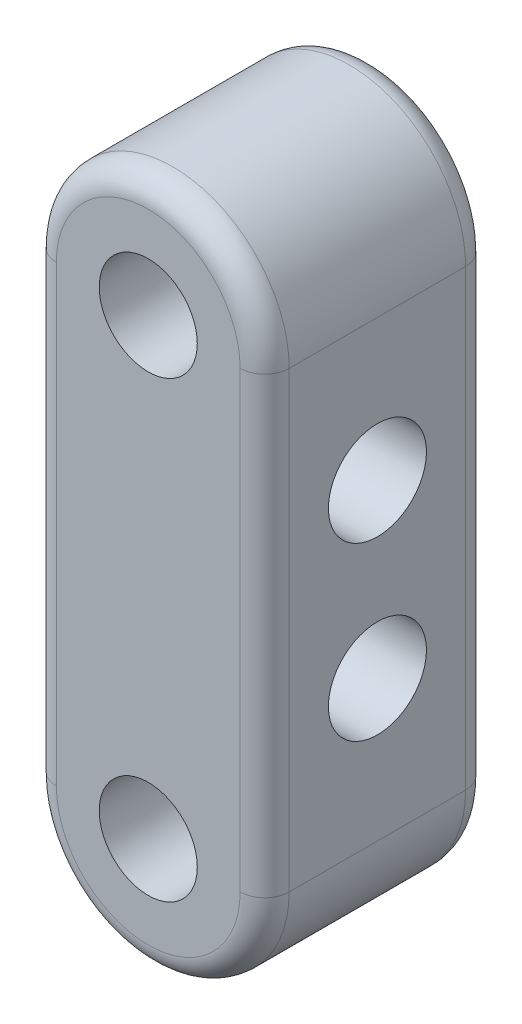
ISO-10303-21;
HEADER;
FILE_DESCRIPTION(('STEP AP214'),'2;1');
FILE_NAME('part.step','',(''),(''),'','','');
FILE_SCHEMA(('AUTOMOTIVE_DESIGN { 1 0 10303 214 1 1 1 1 }'));
ENDSEC;
DATA;
#1=APPLICATION_CONTEXT('core data for automotive mechanical design processes');
#2=APPLICATION_PROTOCOL_DEFINITION('international standard','automotive_design',2000,#1);
#3=PRODUCT_CONTEXT('',#1,'mechanical');
#4=PRODUCT('Part','Part','',(#3));
#5=PRODUCT_RELATED_PRODUCT_CATEGORY('part','',(#4));
#6=PRODUCT_DEFINITION_FORMATION('','',#4);
#7=PRODUCT_DEFINITION_CONTEXT('part definition',#1,'design');
#8=PRODUCT_DEFINITION('design','',#6,#7);
#9=PRODUCT_DEFINITION_SHAPE('','',#8);
#10=(LENGTH_UNIT() NAMED_UNIT(*) SI_UNIT(.MILLI.,.METRE.));
#11=(NAMED_UNIT(*) PLANE_ANGLE_UNIT() SI_UNIT($,.RADIAN.));
#12=(NAMED_UNIT(*) SI_UNIT($,.STERADIAN.) SOLID_ANGLE_UNIT());
#13=UNCERTAINTY_MEASURE_WITH_UNIT(LENGTH_MEASURE(1.E-05),#10,'distance_accuracy_value','');
#14=(GEOMETRIC_REPRESENTATION_CONTEXT(3) GLOBAL_UNCERTAINTY_ASSIGNED_CONTEXT((#13)) GLOBAL_UNIT_ASSIGNED_CONTEXT((#10,
#11,#12)) REPRESENTATION_CONTEXT('',''));
#15=CARTESIAN_POINT('',(0.,0.,0.));
#16=DIRECTION('',(0.,0.,1.));
#17=DIRECTION('',(1.,0.,0.));
#18=AXIS2_PLACEMENT_3D('',#15,#16,#17);
#19=CARTESIAN_POINT('',(4.75,0.,9.2));
#20=DIRECTION('',(0.,0.,-1.));
#21=DIRECTION('',(-1.,0.,0.));
#22=AXIS2_PLACEMENT_3D('',#19,#20,#21);
#23=CYLINDRICAL_SURFACE('',#22,4.75);
#24=DIRECTION('',(0.,0.,-1.));
#25=VECTOR('',#24,1.);
#26=CARTESIAN_POINT('',(0.,0.,9.2));
#27=LINE('',#26,#25);
#28=CARTESIAN_POINT('',(0.,0.,8.2));
#29=VERTEX_POINT('',#28);
#30=CARTESIAN_POINT('',(0.,0.,1.));
#31=VERTEX_POINT('',#30);
#32=EDGE_CURVE('E141',#29,#31,#27,.T.);
#33=ORIENTED_EDGE('',*,*,#32,.T.);
#34=CARTESIAN_POINT('',(4.75,0.,1.));
#35=DIRECTION('',(0.,0.,-1.));
#36=DIRECTION('',(-1.,0.,0.));
#37=AXIS2_PLACEMENT_3D('',#34,#35,#36);
#38=CIRCLE('',#37,4.75);
#39=CARTESIAN_POINT('',(9.50000000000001,0.,1.));
#40=VERTEX_POINT('',#39);
#41=EDGE_CURVE('E51',#31,#40,#38,.F.);
#42=ORIENTED_EDGE('',*,*,#41,.T.);
#43=DIRECTION('',(0.,0.,-1.));
#44=VECTOR('',#43,1.);
#45=CARTESIAN_POINT('',(9.50000000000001,0.,9.2));
#46=LINE('',#45,#44);
#47=CARTESIAN_POINT('',(9.50000000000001,0.,8.2));
#48=VERTEX_POINT('',#47);
#49=EDGE_CURVE('E118',#48,#40,#46,.T.);
#50=ORIENTED_EDGE('',*,*,#49,.F.);
#51=CARTESIAN_POINT('',(4.75,0.,8.2));
#52=DIRECTION('',(0.,0.,-1.));
#53=DIRECTION('',(-1.,0.,0.));
#54=AXIS2_PLACEMENT_3D('',#51,#52,#53);
#55=CIRCLE('',#54,4.75);
#56=EDGE_CURVE('E121',#48,#29,#55,.T.);
#57=ORIENTED_EDGE('',*,*,#56,.T.);
#58=EDGE_LOOP('',(#33,#42,#50,#57));
#59=FACE_BOUND('',#58,.T.);
#60=ADVANCED_FACE('F31',(#59),#23,.T.);
#61=CARTESIAN_POINT('',(9.5,18.5,9.2));
#62=DIRECTION('',(-1.,0.,0.));
#63=DIRECTION('',(0.,-1.,0.));
#64=AXIS2_PLACEMENT_3D('',#61,#62,#63);
#65=PLANE('',#64);
#66=CARTESIAN_POINT('',(9.50000000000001,5.75,4.6));
#67=DIRECTION('',(1.,0.,0.));
#68=DIRECTION('',(0.,1.,0.));
#69=AXIS2_PLACEMENT_3D('',#66,#67,#68);
#70=CIRCLE('',#69,2.);
#71=CARTESIAN_POINT('',(9.50000000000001,7.75,4.6));
#72=VERTEX_POINT('',#71);
#73=EDGE_CURVE('E273',#72,#72,#70,.T.);
#74=ORIENTED_EDGE('',*,*,#73,.F.);
#75=EDGE_LOOP('',(#74));
#76=FACE_BOUND('',#75,.T.);
#77=CARTESIAN_POINT('',(9.50000000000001,12.75,4.6));
#78=DIRECTION('',(1.,0.,0.));
#79=DIRECTION('',(0.,1.,0.));
#80=AXIS2_PLACEMENT_3D('',#77,#78,#79);
#81=CIRCLE('',#80,2.);
#82=CARTESIAN_POINT('',(9.50000000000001,14.75,4.6));
#83=VERTEX_POINT('',#82);
#84=EDGE_CURVE('E275',#83,#83,#81,.T.);
#85=ORIENTED_EDGE('',*,*,#84,.F.);
#86=EDGE_LOOP('',(#85));
#87=FACE_BOUND('',#86,.T.);
#88=ORIENTED_EDGE('',*,*,#49,.T.);
#89=DIRECTION('',(0.,1.,0.));
#90=VECTOR('',#89,1.);
#91=CARTESIAN_POINT('',(9.5,18.5,1.));
#92=LINE('',#91,#90);
#93=CARTESIAN_POINT('',(9.5,18.5,1.));
#94=VERTEX_POINT('',#93);
#95=EDGE_CURVE('E11',#40,#94,#92,.T.);
#96=ORIENTED_EDGE('',*,*,#95,.T.);
#97=DIRECTION('',(0.,0.,-1.));
#98=VECTOR('',#97,1.);
#99=CARTESIAN_POINT('',(9.5,18.5,9.2));
#100=LINE('',#99,#98);
#101=CARTESIAN_POINT('',(9.5,18.5,8.2));
#102=VERTEX_POINT('',#101);
#103=EDGE_CURVE('E146',#102,#94,#100,.T.);
#104=ORIENTED_EDGE('',*,*,#103,.F.);
#105=DIRECTION('',(0.,1.,0.));
#106=VECTOR('',#105,1.);
#107=CARTESIAN_POINT('',(9.5,18.5,8.2));
#108=LINE('',#107,#106);
#109=EDGE_CURVE('E157',#102,#48,#108,.F.);
#110=ORIENTED_EDGE('',*,*,#109,.T.);
#111=EDGE_LOOP('',(#88,#96,#104,#110));
#112=FACE_BOUND('',#111,.T.);
#113=ADVANCED_FACE('F212',(#76,#87,#112),#65,.F.);
#114=CARTESIAN_POINT('',(4.75,18.5,9.2));
#115=DIRECTION('',(0.,0.,-1.));
#116=DIRECTION('',(-1.,0.,0.));
#117=AXIS2_PLACEMENT_3D('',#114,#115,#116);
#118=CYLINDRICAL_SURFACE('',#117,4.75);
#119=ORIENTED_EDGE('',*,*,#103,.T.);
#120=CARTESIAN_POINT('',(4.75,18.5,1.));
#121=DIRECTION('',(0.,0.,-1.));
#122=DIRECTION('',(-1.,0.,0.));
#123=AXIS2_PLACEMENT_3D('',#120,#121,#122);
#124=CIRCLE('',#123,4.75);
#125=CARTESIAN_POINT('',(0.,18.5,1.));
#126=VERTEX_POINT('',#125);
#127=EDGE_CURVE('E38',#94,#126,#124,.F.);
#128=ORIENTED_EDGE('',*,*,#127,.T.);
#129=DIRECTION('',(0.,0.,-1.));
#130=VECTOR('',#129,1.);
#131=CARTESIAN_POINT('',(0.,18.5,9.2));
#132=LINE('',#131,#130);
#133=CARTESIAN_POINT('',(0.,18.5,8.2));
#134=VERTEX_POINT('',#133);
#135=EDGE_CURVE('E143',#134,#126,#132,.T.);
#136=ORIENTED_EDGE('',*,*,#135,.F.);
#137=CARTESIAN_POINT('',(4.75,18.5,8.2));
#138=DIRECTION('',(0.,0.,-1.));
#139=DIRECTION('',(-1.,0.,0.));
#140=AXIS2_PLACEMENT_3D('',#137,#138,#139);
#141=CIRCLE('',#140,4.75);
#142=EDGE_CURVE('E155',#134,#102,#141,.T.);
#143=ORIENTED_EDGE('',*,*,#142,.T.);
#144=EDGE_LOOP('',(#119,#128,#136,#143));
#145=FACE_BOUND('',#144,.T.);
#146=ADVANCED_FACE('F174',(#145),#118,.T.);
#147=CARTESIAN_POINT('',(0.,0.,9.2));
#148=DIRECTION('',(1.,0.,0.));
#149=DIRECTION('',(0.,0.,-1.));
#150=AXIS2_PLACEMENT_3D('',#147,#148,#149);
#151=PLANE('',#150);
#152=CARTESIAN_POINT('',(0.,5.75,4.6));
#153=DIRECTION('',(1.,0.,0.));
#154=DIRECTION('',(0.,1.,0.));
#155=AXIS2_PLACEMENT_3D('',#152,#153,#154);
#156=CIRCLE('',#155,2.);
#157=CARTESIAN_POINT('',(0.,7.75,4.6));
#158=VERTEX_POINT('',#157);
#159=EDGE_CURVE('E271',#158,#158,#156,.T.);
#160=ORIENTED_EDGE('',*,*,#159,.T.);
#161=EDGE_LOOP('',(#160));
#162=FACE_BOUND('',#161,.T.);
#163=CARTESIAN_POINT('',(0.,12.75,4.6));
#164=DIRECTION('',(1.,0.,0.));
#165=DIRECTION('',(0.,1.,0.));
#166=AXIS2_PLACEMENT_3D('',#163,#164,#165);
#167=CIRCLE('',#166,2.);
#168=CARTESIAN_POINT('',(0.,14.75,4.6));
#169=VERTEX_POINT('',#168);
#170=EDGE_CURVE('E196',#169,#169,#167,.T.);
#171=ORIENTED_EDGE('',*,*,#170,.T.);
#172=EDGE_LOOP('',(#171));
#173=FACE_BOUND('',#172,.T.);
#174=ORIENTED_EDGE('',*,*,#135,.T.);
#175=DIRECTION('',(0.,-1.,0.));
#176=VECTOR('',#175,1.);
#177=CARTESIAN_POINT('',(0.,0.,1.));
#178=LINE('',#177,#176);
#179=EDGE_CURVE('E159',#126,#31,#178,.T.);
#180=ORIENTED_EDGE('',*,*,#179,.T.);
#181=ORIENTED_EDGE('',*,*,#32,.F.);
#182=DIRECTION('',(0.,-1.,0.));
#183=VECTOR('',#182,1.);
#184=CARTESIAN_POINT('',(0.,0.,8.2));
#185=LINE('',#184,#183);
#186=EDGE_CURVE('E151',#29,#134,#185,.F.);
#187=ORIENTED_EDGE('',*,*,#186,.T.);
#188=EDGE_LOOP('',(#174,#180,#181,#187));
#189=FACE_BOUND('',#188,.T.);
#190=ADVANCED_FACE('F180',(#162,#173,#189),#151,.F.);
#191=CARTESIAN_POINT('',(4.75,0.,9.2));
#192=DIRECTION('',(0.,0.,-1.));
#193=DIRECTION('',(-1.,0.,0.));
#194=AXIS2_PLACEMENT_3D('',#191,#192,#193);
#195=PLANE('',#194);
#196=CARTESIAN_POINT('',(4.75,18.5,9.2));
#197=DIRECTION('',(0.,0.,-1.));
#198=DIRECTION('',(-1.,0.,0.));
#199=AXIS2_PLACEMENT_3D('',#196,#197,#198);
#200=CIRCLE('',#199,3.75);
#201=CARTESIAN_POINT('',(8.5,18.5,9.2));
#202=VERTEX_POINT('',#201);
#203=CARTESIAN_POINT('',(1.,18.5,9.2));
#204=VERTEX_POINT('',#203);
#205=EDGE_CURVE('E107',#202,#204,#200,.F.);
#206=ORIENTED_EDGE('',*,*,#205,.T.);
#207=DIRECTION('',(0.,-1.,0.));
#208=VECTOR('',#207,1.);
#209=CARTESIAN_POINT('',(1.,0.,9.2));
#210=LINE('',#209,#208);
#211=CARTESIAN_POINT('',(1.,0.,9.2));
#212=VERTEX_POINT('',#211);
#213=EDGE_CURVE('E103',#204,#212,#210,.T.);
#214=ORIENTED_EDGE('',*,*,#213,.T.);
#215=CARTESIAN_POINT('',(4.75,0.,9.2));
#216=DIRECTION('',(0.,0.,-1.));
#217=DIRECTION('',(-1.,0.,0.));
#218=AXIS2_PLACEMENT_3D('',#215,#216,#217);
#219=CIRCLE('',#218,3.75);
#220=CARTESIAN_POINT('',(8.50000000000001,0.,9.2));
#221=VERTEX_POINT('',#220);
#222=EDGE_CURVE('E96',#212,#221,#219,.F.);
#223=ORIENTED_EDGE('',*,*,#222,.T.);
#224=DIRECTION('',(0.,1.,0.));
#225=VECTOR('',#224,1.);
#226=CARTESIAN_POINT('',(8.50000000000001,0.,9.2));
#227=LINE('',#226,#225);
#228=EDGE_CURVE('E100',#221,#202,#227,.T.);
#229=ORIENTED_EDGE('',*,*,#228,.T.);
#230=EDGE_LOOP('',(#206,#214,#223,#229));
#231=FACE_BOUND('',#230,.T.);
#232=CARTESIAN_POINT('',(4.75,0.,9.2));
#233=DIRECTION('',(0.,0.,1.));
#234=DIRECTION('',(1.,0.,0.));
#235=AXIS2_PLACEMENT_3D('',#232,#233,#234);
#236=CIRCLE('',#235,2.);
#237=CARTESIAN_POINT('',(6.75,0.,9.2));
#238=VERTEX_POINT('',#237);
#239=EDGE_CURVE('E124',#238,#238,#236,.T.);
#240=ORIENTED_EDGE('',*,*,#239,.F.);
#241=EDGE_LOOP('',(#240));
#242=FACE_BOUND('',#241,.T.);
#243=CARTESIAN_POINT('',(4.75,18.5,9.2));
#244=DIRECTION('',(0.,0.,1.));
#245=DIRECTION('',(1.,0.,0.));
#246=AXIS2_PLACEMENT_3D('',#243,#244,#245);
#247=CIRCLE('',#246,2.);
#248=CARTESIAN_POINT('',(6.75,18.5,9.2));
#249=VERTEX_POINT('',#248);
#250=EDGE_CURVE('E135',#249,#249,#247,.T.);
#251=ORIENTED_EDGE('',*,*,#250,.F.);
#252=EDGE_LOOP('',(#251));
#253=FACE_BOUND('',#252,.T.);
#254=ADVANCED_FACE('F98',(#231,#242,#253),#195,.F.);
#255=CARTESIAN_POINT('',(4.75,0.,0.));
#256=DIRECTION('',(0.,0.,-1.));
#257=DIRECTION('',(-1.,0.,0.));
#258=AXIS2_PLACEMENT_3D('',#255,#256,#257);
#259=PLANE('',#258);
#260=CARTESIAN_POINT('',(4.75,0.,0.));
#261=DIRECTION('',(0.,0.,-1.));
#262=DIRECTION('',(-1.,0.,0.));
#263=AXIS2_PLACEMENT_3D('',#260,#261,#262);
#264=CIRCLE('',#263,3.75);
#265=CARTESIAN_POINT('',(8.50000000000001,0.,0.));
#266=VERTEX_POINT('',#265);
#267=CARTESIAN_POINT('',(1.,0.,0.));
#268=VERTEX_POINT('',#267);
#269=EDGE_CURVE('E166',#266,#268,#264,.T.);
#270=ORIENTED_EDGE('',*,*,#269,.T.);
#271=DIRECTION('',(0.,-1.,0.));
#272=VECTOR('',#271,1.);
#273=CARTESIAN_POINT('',(1.,18.5,0.));
#274=LINE('',#273,#272);
#275=CARTESIAN_POINT('',(1.,18.5,0.));
#276=VERTEX_POINT('',#275);
#277=EDGE_CURVE('E168',#268,#276,#274,.F.);
#278=ORIENTED_EDGE('',*,*,#277,.T.);
#279=CARTESIAN_POINT('',(4.75,18.5,0.));
#280=DIRECTION('',(0.,0.,-1.));
#281=DIRECTION('',(-1.,0.,0.));
#282=AXIS2_PLACEMENT_3D('',#279,#280,#281);
#283=CIRCLE('',#282,3.75);
#284=CARTESIAN_POINT('',(8.5,18.5,0.));
#285=VERTEX_POINT('',#284);
#286=EDGE_CURVE('E164',#276,#285,#283,.T.);
#287=ORIENTED_EDGE('',*,*,#286,.T.);
#288=DIRECTION('',(0.,1.,0.));
#289=VECTOR('',#288,1.);
#290=CARTESIAN_POINT('',(8.50000000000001,0.,0.));
#291=LINE('',#290,#289);
#292=EDGE_CURVE('E162',#285,#266,#291,.F.);
#293=ORIENTED_EDGE('',*,*,#292,.T.);
#294=EDGE_LOOP('',(#270,#278,#287,#293));
#295=FACE_BOUND('',#294,.T.);
#296=CARTESIAN_POINT('',(4.75,0.,0.));
#297=DIRECTION('',(0.,0.,1.));
#298=DIRECTION('',(1.,0.,0.));
#299=AXIS2_PLACEMENT_3D('',#296,#297,#298);
#300=CIRCLE('',#299,2.);
#301=CARTESIAN_POINT('',(6.75,0.,0.));
#302=VERTEX_POINT('',#301);
#303=EDGE_CURVE('E132',#302,#302,#300,.T.);
#304=ORIENTED_EDGE('',*,*,#303,.T.);
#305=EDGE_LOOP('',(#304));
#306=FACE_BOUND('',#305,.T.);
#307=CARTESIAN_POINT('',(4.75,18.5,0.));
#308=DIRECTION('',(0.,0.,1.));
#309=DIRECTION('',(1.,0.,0.));
#310=AXIS2_PLACEMENT_3D('',#307,#308,#309);
#311=CIRCLE('',#310,2.);
#312=CARTESIAN_POINT('',(6.75,18.5,0.));
#313=VERTEX_POINT('',#312);
#314=EDGE_CURVE('E138',#313,#313,#311,.T.);
#315=ORIENTED_EDGE('',*,*,#314,.T.);
#316=EDGE_LOOP('',(#315));
#317=FACE_BOUND('',#316,.T.);
#318=ADVANCED_FACE('F230',(#295,#306,#317),#259,.T.);
#319=CARTESIAN_POINT('',(4.75,18.5,0.));
#320=DIRECTION('',(0.,0.,1.));
#321=DIRECTION('',(1.,0.,0.));
#322=AXIS2_PLACEMENT_3D('',#319,#320,#321);
#323=CYLINDRICAL_SURFACE('',#322,2.);
#324=ORIENTED_EDGE('',*,*,#314,.F.);
#325=EDGE_LOOP('',(#324));
#326=FACE_BOUND('',#325,.T.);
#327=ORIENTED_EDGE('',*,*,#250,.T.);
#328=EDGE_LOOP('',(#327));
#329=FACE_BOUND('',#328,.T.);
#330=ADVANCED_FACE('F233',(#326,#329),#323,.F.);
#331=CARTESIAN_POINT('',(4.75,0.,0.));
#332=DIRECTION('',(0.,0.,1.));
#333=DIRECTION('',(1.,0.,0.));
#334=AXIS2_PLACEMENT_3D('',#331,#332,#333);
#335=CYLINDRICAL_SURFACE('',#334,2.);
#336=ORIENTED_EDGE('',*,*,#303,.F.);
#337=EDGE_LOOP('',(#336));
#338=FACE_BOUND('',#337,.T.);
#339=ORIENTED_EDGE('',*,*,#239,.T.);
#340=EDGE_LOOP('',(#339));
#341=FACE_BOUND('',#340,.T.);
#342=ADVANCED_FACE('F237',(#338,#341),#335,.F.);
#343=CARTESIAN_POINT('',(8.50000000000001,0.,8.2));
#344=DIRECTION('',(0.,1.,0.));
#345=DIRECTION('',(-1.,0.,0.));
#346=AXIS2_PLACEMENT_3D('',#343,#344,#345);
#347=CYLINDRICAL_SURFACE('',#346,1.);
#348=CARTESIAN_POINT('',(8.5,0.,8.2));
#349=DIRECTION('',(0.,-1.,0.));
#350=DIRECTION('',(1.,0.,0.));
#351=AXIS2_PLACEMENT_3D('',#348,#349,#350);
#352=CIRCLE('',#351,1.);
#353=EDGE_CURVE('E113',#48,#221,#352,.T.);
#354=ORIENTED_EDGE('',*,*,#353,.F.);
#355=ORIENTED_EDGE('',*,*,#109,.F.);
#356=CARTESIAN_POINT('',(8.5,18.5,8.2));
#357=DIRECTION('',(0.,1.,0.));
#358=DIRECTION('',(0.,0.,1.));
#359=AXIS2_PLACEMENT_3D('',#356,#357,#358);
#360=CIRCLE('',#359,1.);
#361=EDGE_CURVE('E116',#202,#102,#360,.T.);
#362=ORIENTED_EDGE('',*,*,#361,.F.);
#363=ORIENTED_EDGE('',*,*,#228,.F.);
#364=EDGE_LOOP('',(#354,#355,#362,#363));
#365=FACE_BOUND('',#364,.T.);
#366=ADVANCED_FACE('F111',(#365),#347,.T.);
#367=CARTESIAN_POINT('',(4.75,18.5,8.2));
#368=DIRECTION('',(0.,0.,-1.));
#369=DIRECTION('',(-1.,0.,0.));
#370=AXIS2_PLACEMENT_3D('',#367,#368,#369);
#371=TOROIDAL_SURFACE('',#370,3.75,1.);
#372=ORIENTED_EDGE('',*,*,#361,.T.);
#373=ORIENTED_EDGE('',*,*,#142,.F.);
#374=CARTESIAN_POINT('',(1.,18.5,8.2));
#375=DIRECTION('',(0.,-1.,0.));
#376=DIRECTION('',(0.,0.,-1.));
#377=AXIS2_PLACEMENT_3D('',#374,#375,#376);
#378=CIRCLE('',#377,1.);
#379=EDGE_CURVE('E122',#204,#134,#378,.T.);
#380=ORIENTED_EDGE('',*,*,#379,.F.);
#381=ORIENTED_EDGE('',*,*,#205,.F.);
#382=EDGE_LOOP('',(#372,#373,#380,#381));
#383=FACE_BOUND('',#382,.T.);
#384=ADVANCED_FACE('F211',(#383),#371,.T.);
#385=CARTESIAN_POINT('',(4.75,0.,8.2));
#386=DIRECTION('',(0.,0.,-1.));
#387=DIRECTION('',(-1.,0.,0.));
#388=AXIS2_PLACEMENT_3D('',#385,#386,#387);
#389=TOROIDAL_SURFACE('',#388,3.75,1.);
#390=ORIENTED_EDGE('',*,*,#353,.T.);
#391=ORIENTED_EDGE('',*,*,#222,.F.);
#392=CARTESIAN_POINT('',(1.,0.,8.2));
#393=DIRECTION('',(0.,1.,0.));
#394=DIRECTION('',(0.,0.,1.));
#395=AXIS2_PLACEMENT_3D('',#392,#393,#394);
#396=CIRCLE('',#395,1.);
#397=EDGE_CURVE('E126',#29,#212,#396,.T.);
#398=ORIENTED_EDGE('',*,*,#397,.F.);
#399=ORIENTED_EDGE('',*,*,#56,.F.);
#400=EDGE_LOOP('',(#390,#391,#398,#399));
#401=FACE_BOUND('',#400,.T.);
#402=ADVANCED_FACE('F120',(#401),#389,.T.);
#403=CARTESIAN_POINT('',(1.,0.,8.2));
#404=DIRECTION('',(0.,-1.,0.));
#405=DIRECTION('',(0.,0.,-1.));
#406=AXIS2_PLACEMENT_3D('',#403,#404,#405);
#407=CYLINDRICAL_SURFACE('',#406,1.);
#408=ORIENTED_EDGE('',*,*,#379,.T.);
#409=ORIENTED_EDGE('',*,*,#186,.F.);
#410=ORIENTED_EDGE('',*,*,#397,.T.);
#411=ORIENTED_EDGE('',*,*,#213,.F.);
#412=EDGE_LOOP('',(#408,#409,#410,#411));
#413=FACE_BOUND('',#412,.T.);
#414=ADVANCED_FACE('F207',(#413),#407,.T.);
#415=CARTESIAN_POINT('',(8.5,18.5,1.));
#416=DIRECTION('',(0.,-1.,0.));
#417=DIRECTION('',(1.,0.,0.));
#418=AXIS2_PLACEMENT_3D('',#415,#416,#417);
#419=CYLINDRICAL_SURFACE('',#418,1.);
#420=CARTESIAN_POINT('',(8.50000000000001,0.,1.));
#421=DIRECTION('',(0.,-1.,0.));
#422=DIRECTION('',(1.,0.,0.));
#423=AXIS2_PLACEMENT_3D('',#420,#421,#422);
#424=CIRCLE('',#423,1.);
#425=EDGE_CURVE('E189',#266,#40,#424,.T.);
#426=ORIENTED_EDGE('',*,*,#425,.F.);
#427=ORIENTED_EDGE('',*,*,#292,.F.);
#428=CARTESIAN_POINT('',(8.5,18.5,1.));
#429=DIRECTION('',(0.,1.,0.));
#430=DIRECTION('',(0.,0.,1.));
#431=AXIS2_PLACEMENT_3D('',#428,#429,#430);
#432=CIRCLE('',#431,1.);
#433=EDGE_CURVE('E203',#94,#285,#432,.T.);
#434=ORIENTED_EDGE('',*,*,#433,.F.);
#435=ORIENTED_EDGE('',*,*,#95,.F.);
#436=EDGE_LOOP('',(#426,#427,#434,#435));
#437=FACE_BOUND('',#436,.T.);
#438=ADVANCED_FACE('F250',(#437),#419,.T.);
#439=CARTESIAN_POINT('',(4.75,18.5,1.));
#440=DIRECTION('',(0.,0.,-1.));
#441=DIRECTION('',(-1.,0.,0.));
#442=AXIS2_PLACEMENT_3D('',#439,#440,#441);
#443=TOROIDAL_SURFACE('',#442,3.75,1.);
#444=ORIENTED_EDGE('',*,*,#433,.T.);
#445=ORIENTED_EDGE('',*,*,#286,.F.);
#446=CARTESIAN_POINT('',(1.,18.5,1.));
#447=DIRECTION('',(0.,-1.,0.));
#448=DIRECTION('',(0.,0.,-1.));
#449=AXIS2_PLACEMENT_3D('',#446,#447,#448);
#450=CIRCLE('',#449,1.);
#451=EDGE_CURVE('E185',#126,#276,#450,.T.);
#452=ORIENTED_EDGE('',*,*,#451,.F.);
#453=ORIENTED_EDGE('',*,*,#127,.F.);
#454=EDGE_LOOP('',(#444,#445,#452,#453));
#455=FACE_BOUND('',#454,.T.);
#456=ADVANCED_FACE('F186',(#455),#443,.T.);
#457=CARTESIAN_POINT('',(4.75,0.,1.));
#458=DIRECTION('',(0.,0.,-1.));
#459=DIRECTION('',(-1.,0.,0.));
#460=AXIS2_PLACEMENT_3D('',#457,#458,#459);
#461=TOROIDAL_SURFACE('',#460,3.75,1.);
#462=ORIENTED_EDGE('',*,*,#425,.T.);
#463=ORIENTED_EDGE('',*,*,#41,.F.);
#464=CARTESIAN_POINT('',(1.,0.,1.));
#465=DIRECTION('',(0.,1.,0.));
#466=DIRECTION('',(0.,0.,1.));
#467=AXIS2_PLACEMENT_3D('',#464,#465,#466);
#468=CIRCLE('',#467,1.);
#469=EDGE_CURVE('E190',#268,#31,#468,.T.);
#470=ORIENTED_EDGE('',*,*,#469,.F.);
#471=ORIENTED_EDGE('',*,*,#269,.F.);
#472=EDGE_LOOP('',(#462,#463,#470,#471));
#473=FACE_BOUND('',#472,.T.);
#474=ADVANCED_FACE('F199',(#473),#461,.T.);
#475=CARTESIAN_POINT('',(1.,0.,1.));
#476=DIRECTION('',(0.,1.,0.));
#477=DIRECTION('',(0.,0.,1.));
#478=AXIS2_PLACEMENT_3D('',#475,#476,#477);
#479=CYLINDRICAL_SURFACE('',#478,1.);
#480=ORIENTED_EDGE('',*,*,#451,.T.);
#481=ORIENTED_EDGE('',*,*,#277,.F.);
#482=ORIENTED_EDGE('',*,*,#469,.T.);
#483=ORIENTED_EDGE('',*,*,#179,.F.);
#484=EDGE_LOOP('',(#480,#481,#482,#483));
#485=FACE_BOUND('',#484,.T.);
#486=ADVANCED_FACE('F192',(#485),#479,.T.);
#487=CARTESIAN_POINT('',(0.,12.75,4.6));
#488=DIRECTION('',(1.,0.,0.));
#489=DIRECTION('',(0.,1.,0.));
#490=AXIS2_PLACEMENT_3D('',#487,#488,#489);
#491=CYLINDRICAL_SURFACE('',#490,2.);
#492=ORIENTED_EDGE('',*,*,#170,.F.);
#493=EDGE_LOOP('',(#492));
#494=FACE_BOUND('',#493,.T.);
#495=ORIENTED_EDGE('',*,*,#84,.T.);
#496=EDGE_LOOP('',(#495));
#497=FACE_BOUND('',#496,.T.);
#498=ADVANCED_FACE('F259',(#494,#497),#491,.F.);
#499=CARTESIAN_POINT('',(0.,5.75,4.6));
#500=DIRECTION('',(1.,0.,0.));
#501=DIRECTION('',(0.,1.,0.));
#502=AXIS2_PLACEMENT_3D('',#499,#500,#501);
#503=CYLINDRICAL_SURFACE('',#502,2.);
#504=ORIENTED_EDGE('',*,*,#159,.F.);
#505=EDGE_LOOP('',(#504));
#506=FACE_BOUND('',#505,.T.);
#507=ORIENTED_EDGE('',*,*,#73,.T.);
#508=EDGE_LOOP('',(#507));
#509=FACE_BOUND('',#508,.T.);
#510=ADVANCED_FACE('F262',(#506,#509),#503,.F.);
#511=CLOSED_SHELL('',(#60,#113,#146,#190,#254,#318,#330,#342,#366,#384,#402,#414,#438,#456,#474,
#486,#498,#510));
#512=MANIFOLD_SOLID_BREP('B2',#511);
#513=ADVANCED_BREP_SHAPE_REPRESENTATION('',(#18,#512),#14);
#514=SHAPE_DEFINITION_REPRESENTATION(#9,#513);
ENDSEC;
END-ISO-10303-21;
